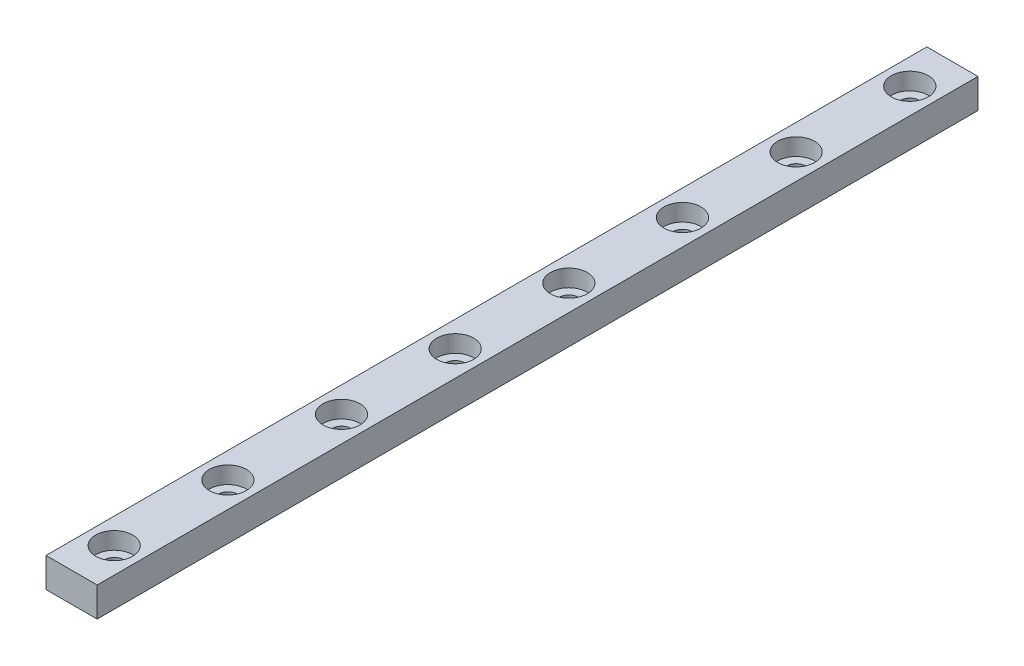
from build123d import *

# Parameters (mm, degrees)
SKETCH1_W                      = 155
SKETCH1_H                      = 5.2
BOSS_EXTRUDE1_DEPTH            = 4.5
CBORE_FOR_M3_SHCS1_D           = 3.4
CBORE_FOR_M3_SHCS1_CBORE_D     = 6.5
CBORE_FOR_M3_SHCS1_CBORE_DEPTH = 3


with BuildPart() as part:
    # Sketch1 → Boss-Extrude1 (new, symmetric)
    with BuildSketch(Plane(origin=(0, 0, 0), x_dir=(0, 0, -1), z_dir=(1, 0, 0))):
        with Locations((77.5, 2.6)):
            Rectangle(SKETCH1_W, SKETCH1_H)
    extrude(amount=BOSS_EXTRUDE1_DEPTH, both=True)

    # CBORE for M3 SHCS1 (through all)
    with Locations(Plane(origin=(0, 5.2, 0), x_dir=(1, 0, 0), z_dir=(0, 1, 0))):
        with Locations((0, 87.5), (0, 147.5), (0, 127.5), (0, 107.5), (0, 67.5), (0, 47.5), (0, 27.5), (0, 7.5)):
            CounterBoreHole(CBORE_FOR_M3_SHCS1_D / 2, CBORE_FOR_M3_SHCS1_CBORE_D / 2, CBORE_FOR_M3_SHCS1_CBORE_DEPTH)


solid = part.part
